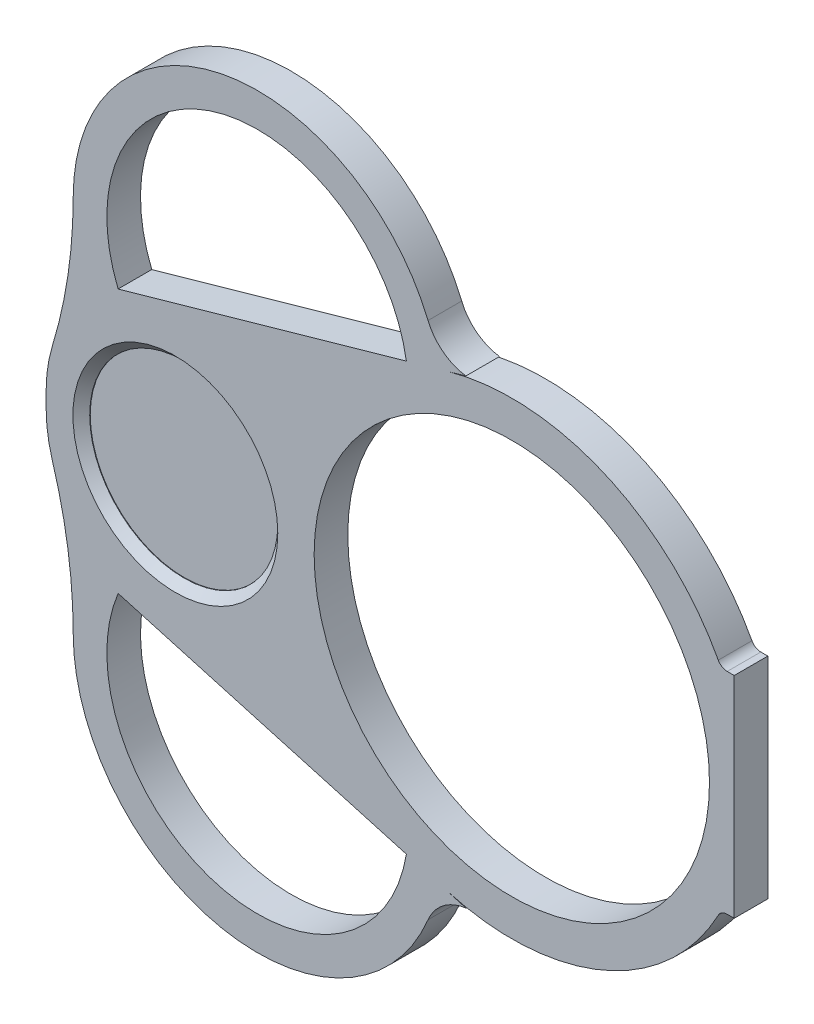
ISO-10303-21;
HEADER;
FILE_DESCRIPTION(('STEP AP214'),'2;1');
FILE_NAME('part.step','',(''),(''),'','','');
FILE_SCHEMA(('AUTOMOTIVE_DESIGN { 1 0 10303 214 1 1 1 1 }'));
ENDSEC;
DATA;
#1=APPLICATION_CONTEXT('core data for automotive mechanical design processes');
#2=APPLICATION_PROTOCOL_DEFINITION('international standard','automotive_design',2000,#1);
#3=PRODUCT_CONTEXT('',#1,'mechanical');
#4=PRODUCT('Part','Part','',(#3));
#5=PRODUCT_RELATED_PRODUCT_CATEGORY('part','',(#4));
#6=PRODUCT_DEFINITION_FORMATION('','',#4);
#7=PRODUCT_DEFINITION_CONTEXT('part definition',#1,'design');
#8=PRODUCT_DEFINITION('design','',#6,#7);
#9=PRODUCT_DEFINITION_SHAPE('','',#8);
#10=(LENGTH_UNIT() NAMED_UNIT(*) SI_UNIT(.MILLI.,.METRE.));
#11=(NAMED_UNIT(*) PLANE_ANGLE_UNIT() SI_UNIT($,.RADIAN.));
#12=(NAMED_UNIT(*) SI_UNIT($,.STERADIAN.) SOLID_ANGLE_UNIT());
#13=UNCERTAINTY_MEASURE_WITH_UNIT(LENGTH_MEASURE(1.E-05),#10,'distance_accuracy_value','');
#14=(GEOMETRIC_REPRESENTATION_CONTEXT(3) GLOBAL_UNCERTAINTY_ASSIGNED_CONTEXT((#13)) GLOBAL_UNIT_ASSIGNED_CONTEXT((#10,
#11,#12)) REPRESENTATION_CONTEXT('',''));
#15=CARTESIAN_POINT('',(0.,0.,0.));
#16=DIRECTION('',(0.,0.,1.));
#17=DIRECTION('',(1.,0.,0.));
#18=AXIS2_PLACEMENT_3D('',#15,#16,#17);
#19=CARTESIAN_POINT('',(-9.4234,0.,-1.016));
#20=DIRECTION('',(0.,0.,-1.));
#21=DIRECTION('',(-1.,0.,0.));
#22=AXIS2_PLACEMENT_3D('',#19,#20,#21);
#23=PLANE('',#22);
#24=CARTESIAN_POINT('',(-9.4234,0.,-1.0159999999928));
#25=DIRECTION('',(0.,0.,1.));
#26=DIRECTION('',(1.,0.,0.));
#27=AXIS2_PLACEMENT_3D('',#24,#25,#26);
#28=CIRCLE('',#27,6.46429999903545);
#29=CARTESIAN_POINT('',(-2.95910000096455,0.,-1.0159999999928));
#30=VERTEX_POINT('',#29);
#31=EDGE_CURVE('P0_E17',#30,#30,#28,.T.);
#32=ORIENTED_EDGE('',*,*,#31,.F.);
#33=EDGE_LOOP('',(#32));
#34=FACE_BOUND('',#33,.T.);
#35=ADVANCED_FACE('P0_F14',(#34),#23,.T.);
#36=CARTESIAN_POINT('',(-9.4234,0.,-0.381000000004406));
#37=DIRECTION('',(0.,0.,1.));
#38=DIRECTION('',(1.,0.,0.));
#39=AXIS2_PLACEMENT_3D('',#36,#37,#38);
#40=CONICAL_SURFACE('',#39,7.09929999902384,0.785398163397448);
#41=CARTESIAN_POINT('',(-9.4234,0.,-0.381000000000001));
#42=DIRECTION('',(0.,0.,-1.));
#43=DIRECTION('',(-1.,0.,0.));
#44=AXIS2_PLACEMENT_3D('',#41,#42,#43);
#45=CIRCLE('',#44,7.09929999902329);
#46=CARTESIAN_POINT('',(-16.5226999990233,0.,-0.381000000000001));
#47=VERTEX_POINT('',#46);
#48=EDGE_CURVE('P0_E21',#47,#47,#45,.F.);
#49=ORIENTED_EDGE('',*,*,#48,.F.);
#50=EDGE_LOOP('',(#49));
#51=FACE_BOUND('',#50,.T.);
#52=ORIENTED_EDGE('',*,*,#31,.T.);
#53=EDGE_LOOP('',(#52));
#54=FACE_BOUND('',#53,.T.);
#55=ADVANCED_FACE('P0_F31',(#51,#54),#40,.T.);
#56=CARTESIAN_POINT('',(-9.4234,0.,1.86626746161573));
#57=DIRECTION('',(0.,0.,-1.));
#58=DIRECTION('',(-1.,0.,0.));
#59=AXIS2_PLACEMENT_3D('',#56,#57,#58);
#60=CYLINDRICAL_SURFACE('',#59,7.09929999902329);
#61=ORIENTED_EDGE('',*,*,#48,.T.);
#62=EDGE_LOOP('',(#61));
#63=FACE_BOUND('',#62,.T.);
#64=CARTESIAN_POINT('',(-9.4234,0.,1.86626746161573));
#65=DIRECTION('',(0.,0.,-1.));
#66=DIRECTION('',(-1.,0.,0.));
#67=AXIS2_PLACEMENT_3D('',#64,#65,#66);
#68=CIRCLE('',#67,7.09929999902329);
#69=CARTESIAN_POINT('',(-16.5226999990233,0.,1.86626746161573));
#70=VERTEX_POINT('',#69);
#71=EDGE_CURVE('P0_E10',#70,#70,#68,.T.);
#72=ORIENTED_EDGE('',*,*,#71,.T.);
#73=EDGE_LOOP('',(#72));
#74=FACE_BOUND('',#73,.T.);
#75=ADVANCED_FACE('P0_F38',(#63,#74),#60,.T.);
#76=CARTESIAN_POINT('',(-9.4234,0.,1.86626746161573));
#77=DIRECTION('',(0.,0.,-1.));
#78=DIRECTION('',(-1.,0.,0.));
#79=AXIS2_PLACEMENT_3D('',#76,#77,#78);
#80=PLANE('',#79);
#81=ORIENTED_EDGE('',*,*,#71,.F.);
#82=EDGE_LOOP('',(#81));
#83=FACE_BOUND('',#82,.T.);
#84=ADVANCED_FACE('P0_F40',(#83),#80,.F.);
#85=CLOSED_SHELL('',(#35,#55,#75,#84));
#86=MANIFOLD_SOLID_BREP('P0_B1',#85);
#87=CARTESIAN_POINT('',(-19.177,0.,2.54));
#88=DIRECTION('',(1.,0.,0.));
#89=DIRECTION('',(0.,1.,0.));
#90=AXIS2_PLACEMENT_3D('',#87,#88,#89);
#91=PLANE('',#90);
#92=DIRECTION('',(0.,0.,-1.));
#93=VECTOR('',#92,1.);
#94=CARTESIAN_POINT('',(-19.177,-0.584199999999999,2.54));
#95=LINE('',#94,#93);
#96=CARTESIAN_POINT('',(-19.177,-0.584199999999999,2.54));
#97=VERTEX_POINT('',#96);
#98=CARTESIAN_POINT('',(-19.177,-0.584200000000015,0.));
#99=VERTEX_POINT('',#98);
#100=EDGE_CURVE('P1_E269',#97,#99,#95,.T.);
#101=ORIENTED_EDGE('',*,*,#100,.F.);
#102=DIRECTION('',(0.,1.,0.));
#103=VECTOR('',#102,1.);
#104=CARTESIAN_POINT('',(-19.177,0.,2.54));
#105=LINE('',#104,#103);
#106=CARTESIAN_POINT('',(-19.177,0.584199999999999,2.54));
#107=VERTEX_POINT('',#106);
#108=EDGE_CURVE('P1_E342',#107,#97,#105,.F.);
#109=ORIENTED_EDGE('',*,*,#108,.F.);
#110=DIRECTION('',(0.,0.,-1.));
#111=VECTOR('',#110,1.);
#112=CARTESIAN_POINT('',(-19.177,0.584199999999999,2.54));
#113=LINE('',#112,#111);
#114=CARTESIAN_POINT('',(-19.177,0.584199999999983,0.));
#115=VERTEX_POINT('',#114);
#116=EDGE_CURVE('P1_E273',#115,#107,#113,.F.);
#117=ORIENTED_EDGE('',*,*,#116,.F.);
#118=DIRECTION('',(0.,1.,0.));
#119=VECTOR('',#118,1.);
#120=CARTESIAN_POINT('',(-19.177,0.,0.));
#121=LINE('',#120,#119);
#122=EDGE_CURVE('P1_E167',#99,#115,#121,.T.);
#123=ORIENTED_EDGE('',*,*,#122,.F.);
#124=EDGE_LOOP('',(#101,#109,#117,#123));
#125=FACE_BOUND('',#124,.T.);
#126=ADVANCED_FACE('P1_F16',(#125),#91,.F.);
#127=CARTESIAN_POINT('',(32.2359681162,-8.6995,2.54));
#128=DIRECTION('',(0.,0.,-1.));
#129=DIRECTION('',(-1.,0.,0.));
#130=AXIS2_PLACEMENT_3D('',#127,#128,#129);
#131=CYLINDRICAL_SURFACE('',#130,0.761999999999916);
#132=DIRECTION('',(0.,0.,1.));
#133=VECTOR('',#132,1.);
#134=CARTESIAN_POINT('',(32.2359681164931,-7.93750000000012,2.54));
#135=LINE('',#134,#133);
#136=CARTESIAN_POINT('',(32.2359681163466,-7.93750000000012,2.54));
#137=VERTEX_POINT('',#136);
#138=CARTESIAN_POINT('',(32.2359681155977,-7.93750000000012,0.));
#139=VERTEX_POINT('',#138);
#140=EDGE_CURVE('P1_E159',#137,#139,#135,.F.);
#141=ORIENTED_EDGE('',*,*,#140,.F.);
#142=CARTESIAN_POINT('',(32.2359681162,-8.6995,2.54));
#143=DIRECTION('',(0.,0.,-1.));
#144=DIRECTION('',(-1.,0.,0.));
#145=AXIS2_PLACEMENT_3D('',#142,#143,#144);
#146=CIRCLE('',#145,0.761999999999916);
#147=CARTESIAN_POINT('',(31.5640934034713,-8.34001652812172,2.54));
#148=VERTEX_POINT('',#147);
#149=EDGE_CURVE('P1_E288',#148,#137,#146,.T.);
#150=ORIENTED_EDGE('',*,*,#149,.F.);
#151=DIRECTION('',(0.,0.,-1.));
#152=VECTOR('',#151,1.);
#153=CARTESIAN_POINT('',(31.5640934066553,-8.34001652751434,2.54));
#154=LINE('',#153,#152);
#155=CARTESIAN_POINT('',(31.5640934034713,-8.34001652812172,0.));
#156=VERTEX_POINT('',#155);
#157=EDGE_CURVE('P1_E161',#156,#148,#154,.F.);
#158=ORIENTED_EDGE('',*,*,#157,.F.);
#159=CARTESIAN_POINT('',(32.2359681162,-8.6995,0.));
#160=DIRECTION('',(0.,0.,-1.));
#161=DIRECTION('',(-1.,0.,0.));
#162=AXIS2_PLACEMENT_3D('',#159,#160,#161);
#163=CIRCLE('',#162,0.761999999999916);
#164=EDGE_CURVE('P1_E19',#139,#156,#163,.F.);
#165=ORIENTED_EDGE('',*,*,#164,.F.);
#166=EDGE_LOOP('',(#141,#150,#158,#165));
#167=FACE_BOUND('',#166,.T.);
#168=ADVANCED_FACE('P1_F157',(#167),#131,.F.);
#169=CARTESIAN_POINT('',(-3.63293960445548,-12.8163730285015,2.54));
#170=DIRECTION('',(-0.272716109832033,-0.962094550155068,0.));
#171=DIRECTION('',(0.962094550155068,-0.272716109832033,0.));
#172=AXIS2_PLACEMENT_3D('',#169,#170,#171);
#173=PLANE('',#172);
#174=DIRECTION('',(0.,0.,-1.));
#175=VECTOR('',#174,1.);
#176=CARTESIAN_POINT('',(11.1554155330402,-17.0082922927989,2.54));
#177=LINE('',#176,#175);
#178=CARTESIAN_POINT('',(11.1554155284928,-17.0082922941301,2.54));
#179=VERTEX_POINT('',#178);
#180=CARTESIAN_POINT('',(11.1554155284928,-17.0082922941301,0.));
#181=VERTEX_POINT('',#180);
#182=EDGE_CURVE('P1_E253',#179,#181,#177,.T.);
#183=ORIENTED_EDGE('',*,*,#182,.F.);
#184=DIRECTION('',(-0.962094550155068,0.272716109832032,0.));
#185=VECTOR('',#184,1.);
#186=CARTESIAN_POINT('',(12.511348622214,-17.3926462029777,2.54));
#187=LINE('',#186,#185);
#188=CARTESIAN_POINT('',(12.511348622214,-17.3926462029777,2.54));
#189=VERTEX_POINT('',#188);
#190=EDGE_CURVE('P1_E290',#189,#179,#187,.T.);
#191=ORIENTED_EDGE('',*,*,#190,.F.);
#192=DIRECTION('',(0.,0.,-1.));
#193=VECTOR('',#192,1.);
#194=CARTESIAN_POINT('',(12.511348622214,-17.3926462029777,2.54));
#195=LINE('',#194,#193);
#196=CARTESIAN_POINT('',(12.511348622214,-17.3926462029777,0.));
#197=VERTEX_POINT('',#196);
#198=EDGE_CURVE('P1_E257',#189,#197,#195,.T.);
#199=ORIENTED_EDGE('',*,*,#198,.T.);
#200=DIRECTION('',(0.962094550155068,-0.272716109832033,0.));
#201=VECTOR('',#200,1.);
#202=CARTESIAN_POINT('',(-3.63293960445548,-12.8163730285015,0.));
#203=LINE('',#202,#201);
#204=EDGE_CURVE('P1_E166',#181,#197,#203,.T.);
#205=ORIENTED_EDGE('',*,*,#204,.F.);
#206=EDGE_LOOP('',(#183,#191,#199,#205));
#207=FACE_BOUND('',#206,.T.);
#208=ADVANCED_FACE('P1_F641',(#207),#173,.F.);
#209=CARTESIAN_POINT('',(1.56023529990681E-08,-7.93750006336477,2.54));
#210=DIRECTION('',(1.96565075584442E-09,-1.,0.));
#211=DIRECTION('',(1.,1.96565075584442E-09,0.));
#212=AXIS2_PLACEMENT_3D('',#209,#210,#211);
#213=PLANE('',#212);
#214=DIRECTION('',(1.,0.,0.));
#215=VECTOR('',#214,1.);
#216=CARTESIAN_POINT('',(0.,-7.93750000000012,2.54));
#217=LINE('',#216,#215);
#218=CARTESIAN_POINT('',(32.766,-7.93749999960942,2.54));
#219=VERTEX_POINT('',#218);
#220=EDGE_CURVE('P1_E175',#137,#219,#217,.T.);
#221=ORIENTED_EDGE('',*,*,#220,.F.);
#222=ORIENTED_EDGE('',*,*,#140,.T.);
#223=DIRECTION('',(1.,1.96565075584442E-09,0.));
#224=VECTOR('',#223,1.);
#225=CARTESIAN_POINT('',(1.56023529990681E-08,-7.93750006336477,0.));
#226=LINE('',#225,#224);
#227=CARTESIAN_POINT('',(32.766,-7.93749999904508,0.));
#228=VERTEX_POINT('',#227);
#229=EDGE_CURVE('P1_E172',#139,#228,#226,.T.);
#230=ORIENTED_EDGE('',*,*,#229,.T.);
#231=DIRECTION('',(0.,0.,1.));
#232=VECTOR('',#231,1.);
#233=CARTESIAN_POINT('',(32.766,-7.93749999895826,2.54));
#234=LINE('',#233,#232);
#235=EDGE_CURVE('P1_E315',#228,#219,#234,.T.);
#236=ORIENTED_EDGE('',*,*,#235,.T.);
#237=EDGE_LOOP('',(#221,#222,#230,#236));
#238=FACE_BOUND('',#237,.T.);
#239=ADVANCED_FACE('P1_F170',(#238),#213,.T.);
#240=CARTESIAN_POINT('',(1.56004825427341E-08,7.93750006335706,2.54));
#241=DIRECTION('',(1.96541510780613E-09,1.,0.));
#242=DIRECTION('',(-1.,1.96541510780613E-09,0.));
#243=AXIS2_PLACEMENT_3D('',#240,#241,#242);
#244=PLANE('',#243);
#245=DIRECTION('',(1.,0.,0.));
#246=VECTOR('',#245,1.);
#247=CARTESIAN_POINT('',(0.,7.93749999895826,2.54));
#248=LINE('',#247,#246);
#249=CARTESIAN_POINT('',(32.766,7.93749999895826,2.54));
#250=VERTEX_POINT('',#249);
#251=CARTESIAN_POINT('',(32.2359681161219,7.93750000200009,2.54));
#252=VERTEX_POINT('',#251);
#253=EDGE_CURVE('P1_E287',#250,#252,#248,.F.);
#254=ORIENTED_EDGE('',*,*,#253,.F.);
#255=DIRECTION('',(0.,0.,1.));
#256=VECTOR('',#255,1.);
#257=CARTESIAN_POINT('',(32.766,7.93749999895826,2.54));
#258=LINE('',#257,#256);
#259=CARTESIAN_POINT('',(32.766,7.93749999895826,0.));
#260=VERTEX_POINT('',#259);
#261=EDGE_CURVE('P1_E307',#250,#260,#258,.F.);
#262=ORIENTED_EDGE('',*,*,#261,.T.);
#263=DIRECTION('',(-1.,1.96541510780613E-09,0.));
#264=VECTOR('',#263,1.);
#265=CARTESIAN_POINT('',(1.56004825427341E-08,7.93750006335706,0.));
#266=LINE('',#265,#264);
#267=CARTESIAN_POINT('',(32.235968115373,7.93750000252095,0.));
#268=VERTEX_POINT('',#267);
#269=EDGE_CURVE('P1_E176',#260,#268,#266,.T.);
#270=ORIENTED_EDGE('',*,*,#269,.T.);
#271=DIRECTION('',(0.,0.,-1.));
#272=VECTOR('',#271,1.);
#273=CARTESIAN_POINT('',(32.2359681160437,7.93750000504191,2.54));
#274=LINE('',#273,#272);
#275=EDGE_CURVE('P1_E295',#268,#252,#274,.F.);
#276=ORIENTED_EDGE('',*,*,#275,.T.);
#277=EDGE_LOOP('',(#254,#262,#270,#276));
#278=FACE_BOUND('',#277,.T.);
#279=ADVANCED_FACE('P1_F329',(#278),#244,.T.);
#280=CARTESIAN_POINT('',(-3.63293960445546,12.8163730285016,2.54));
#281=DIRECTION('',(0.272716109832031,-0.962094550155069,0.));
#282=DIRECTION('',(0.962094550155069,0.272716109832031,0.));
#283=AXIS2_PLACEMENT_3D('',#280,#281,#282);
#284=PLANE('',#283);
#285=DIRECTION('',(0.962094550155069,0.27271610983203,0.));
#286=VECTOR('',#285,1.);
#287=CARTESIAN_POINT('',(11.1554155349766,17.0082922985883,2.54));
#288=LINE('',#287,#286);
#289=CARTESIAN_POINT('',(11.155415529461,17.0082922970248,2.54));
#290=VERTEX_POINT('',#289);
#291=CARTESIAN_POINT('',(12.511348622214,17.3926462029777,2.54));
#292=VERTEX_POINT('',#291);
#293=EDGE_CURVE('P1_E293',#290,#292,#288,.T.);
#294=ORIENTED_EDGE('',*,*,#293,.F.);
#295=DIRECTION('',(0.,0.,-1.));
#296=VECTOR('',#295,1.);
#297=CARTESIAN_POINT('',(11.1554155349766,17.0082922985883,2.54));
#298=LINE('',#297,#296);
#299=CARTESIAN_POINT('',(11.155415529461,17.0082922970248,0.));
#300=VERTEX_POINT('',#299);
#301=EDGE_CURVE('P1_E249',#300,#290,#298,.F.);
#302=ORIENTED_EDGE('',*,*,#301,.F.);
#303=DIRECTION('',(0.962094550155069,0.272716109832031,0.));
#304=VECTOR('',#303,1.);
#305=CARTESIAN_POINT('',(-3.63293960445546,12.8163730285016,0.));
#306=LINE('',#305,#304);
#307=CARTESIAN_POINT('',(12.511348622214,17.3926462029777,0.));
#308=VERTEX_POINT('',#307);
#309=EDGE_CURVE('P1_E298',#300,#308,#306,.T.);
#310=ORIENTED_EDGE('',*,*,#309,.T.);
#311=DIRECTION('',(0.,0.,-1.));
#312=VECTOR('',#311,1.);
#313=CARTESIAN_POINT('',(12.511348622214,17.3926462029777,2.54));
#314=LINE('',#313,#312);
#315=EDGE_CURVE('P1_E284',#308,#292,#314,.F.);
#316=ORIENTED_EDGE('',*,*,#315,.T.);
#317=EDGE_LOOP('',(#294,#302,#310,#316));
#318=FACE_BOUND('',#317,.T.);
#319=ADVANCED_FACE('P1_F381',(#318),#284,.T.);
#320=CARTESIAN_POINT('',(32.2359681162,8.6995,2.54));
#321=DIRECTION('',(0.,0.,-1.));
#322=DIRECTION('',(-1.,0.,0.));
#323=AXIS2_PLACEMENT_3D('',#320,#321,#322);
#324=CYLINDRICAL_SURFACE('',#323,0.761999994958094);
#325=DIRECTION('',(0.,0.,-1.));
#326=VECTOR('',#325,1.);
#327=CARTESIAN_POINT('',(31.5640934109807,8.34001653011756,2.54));
#328=LINE('',#327,#326);
#329=CARTESIAN_POINT('',(31.5640934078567,8.34001653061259,2.54));
#330=VERTEX_POINT('',#329);
#331=CARTESIAN_POINT('',(31.5640934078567,8.34001653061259,0.));
#332=VERTEX_POINT('',#331);
#333=EDGE_CURVE('P1_E245',#330,#332,#328,.T.);
#334=ORIENTED_EDGE('',*,*,#333,.F.);
#335=CARTESIAN_POINT('',(32.2359681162,8.6995,2.54));
#336=DIRECTION('',(0.,0.,-1.));
#337=DIRECTION('',(-1.,0.,0.));
#338=AXIS2_PLACEMENT_3D('',#335,#336,#337);
#339=CIRCLE('',#338,0.761999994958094);
#340=EDGE_CURVE('P1_E285',#252,#330,#339,.T.);
#341=ORIENTED_EDGE('',*,*,#340,.F.);
#342=ORIENTED_EDGE('',*,*,#275,.F.);
#343=CARTESIAN_POINT('',(32.2359681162,8.6995,0.));
#344=DIRECTION('',(0.,0.,-1.));
#345=DIRECTION('',(-1.,0.,0.));
#346=AXIS2_PLACEMENT_3D('',#343,#344,#345);
#347=CIRCLE('',#346,0.761999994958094);
#348=EDGE_CURVE('P1_E294',#332,#268,#347,.F.);
#349=ORIENTED_EDGE('',*,*,#348,.F.);
#350=EDGE_LOOP('',(#334,#341,#342,#349));
#351=FACE_BOUND('',#350,.T.);
#352=ADVANCED_FACE('P1_F401',(#351),#324,.F.);
#353=CARTESIAN_POINT('',(-9.4234,0.,2.54));
#354=DIRECTION('',(0.,0.,1.));
#355=DIRECTION('',(1.,0.,0.));
#356=AXIS2_PLACEMENT_3D('',#353,#354,#355);
#357=CONICAL_SURFACE('',#356,7.7342999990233,0.785398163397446);
#358=CARTESIAN_POINT('',(-9.4234,0.,2.54));
#359=DIRECTION('',(0.,0.,1.));
#360=DIRECTION('',(1.,0.,0.));
#361=AXIS2_PLACEMENT_3D('',#358,#359,#360);
#362=CIRCLE('',#361,7.7342999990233);
#363=CARTESIAN_POINT('',(-1.68910000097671,0.,2.54));
#364=VERTEX_POINT('',#363);
#365=EDGE_CURVE('P1_E291',#364,#364,#362,.F.);
#366=ORIENTED_EDGE('',*,*,#365,.F.);
#367=EDGE_LOOP('',(#366));
#368=FACE_BOUND('',#367,.T.);
#369=CARTESIAN_POINT('',(-9.4234,0.,1.90499999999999));
#370=DIRECTION('',(0.,0.,-1.));
#371=DIRECTION('',(-1.,0.,0.));
#372=AXIS2_PLACEMENT_3D('',#369,#370,#371);
#373=CIRCLE('',#372,7.09929999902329);
#374=CARTESIAN_POINT('',(-16.5226999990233,0.,1.90499999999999));
#375=VERTEX_POINT('',#374);
#376=EDGE_CURVE('P1_E236',#375,#375,#373,.T.);
#377=ORIENTED_EDGE('',*,*,#376,.T.);
#378=EDGE_LOOP('',(#377));
#379=FACE_BOUND('',#378,.T.);
#380=ADVANCED_FACE('P1_F403',(#368,#379),#357,.F.);
#381=CARTESIAN_POINT('',(0.,0.,2.54));
#382=DIRECTION('',(0.,0.,1.));
#383=DIRECTION('',(1.,0.,0.));
#384=AXIS2_PLACEMENT_3D('',#381,#382,#383);
#385=PLANE('',#384);
#386=DIRECTION('',(-0.96209455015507,-0.272716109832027,0.));
#387=VECTOR('',#386,1.);
#388=CARTESIAN_POINT('',(-3.63293960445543,12.8163730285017,2.54));
#389=LINE('',#388,#387);
#390=CARTESIAN_POINT('',(-13.7440850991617,9.95025943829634,2.54));
#391=VERTEX_POINT('',#390);
#392=CARTESIAN_POINT('',(8.01865249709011,16.1191428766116,2.54));
#393=VERTEX_POINT('',#392);
#394=EDGE_CURVE('P1_E335',#391,#393,#389,.F.);
#395=ORIENTED_EDGE('',*,*,#394,.F.);
#396=CARTESIAN_POINT('',(-3.21189337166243,14.2665365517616,2.54));
#397=DIRECTION('',(0.,0.,-1.));
#398=DIRECTION('',(-1.,0.,0.));
#399=AXIS2_PLACEMENT_3D('',#396,#397,#398);
#400=CIRCLE('',#399,11.3823244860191);
#401=EDGE_CURVE('P1_E232',#391,#393,#400,.T.);
#402=ORIENTED_EDGE('',*,*,#401,.T.);
#403=EDGE_LOOP('',(#395,#402));
#404=FACE_BOUND('',#403,.T.);
#405=DIRECTION('',(-0.96209455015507,0.272716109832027,0.));
#406=VECTOR('',#405,1.);
#407=CARTESIAN_POINT('',(-3.63293960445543,-12.8163730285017,2.54));
#408=LINE('',#407,#406);
#409=CARTESIAN_POINT('',(-13.7440850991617,-9.95025943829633,2.54));
#410=VERTEX_POINT('',#409);
#411=CARTESIAN_POINT('',(8.01865249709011,-16.1191428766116,2.54));
#412=VERTEX_POINT('',#411);
#413=EDGE_CURVE('P1_E244',#410,#412,#408,.F.);
#414=ORIENTED_EDGE('',*,*,#413,.T.);
#415=CARTESIAN_POINT('',(-3.21189337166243,-14.2665365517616,2.54));
#416=DIRECTION('',(0.,0.,-1.));
#417=DIRECTION('',(-1.,0.,0.));
#418=AXIS2_PLACEMENT_3D('',#415,#416,#417);
#419=CIRCLE('',#418,11.3823244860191);
#420=EDGE_CURVE('P1_E237',#412,#410,#419,.T.);
#421=ORIENTED_EDGE('',*,*,#420,.T.);
#422=EDGE_LOOP('',(#414,#421));
#423=FACE_BOUND('',#422,.T.);
#424=CARTESIAN_POINT('',(15.9765999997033,-7.72285374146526E-08,2.54));
#425=DIRECTION('',(0.,0.,-1.));
#426=DIRECTION('',(-1.,0.,0.));
#427=AXIS2_PLACEMENT_3D('',#424,#425,#426);
#428=CIRCLE('',#427,14.9224999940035);
#429=CARTESIAN_POINT('',(1.05410000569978,-7.72285374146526E-08,2.54));
#430=VERTEX_POINT('',#429);
#431=EDGE_CURVE('P1_E241',#430,#430,#428,.T.);
#432=ORIENTED_EDGE('',*,*,#431,.T.);
#433=EDGE_LOOP('',(#432));
#434=FACE_BOUND('',#433,.T.);
#435=ORIENTED_EDGE('',*,*,#253,.T.);
#436=ORIENTED_EDGE('',*,*,#340,.T.);
#437=CARTESIAN_POINT('',(15.9766,0.,2.54));
#438=DIRECTION('',(0.,0.,-1.));
#439=DIRECTION('',(-1.,0.,0.));
#440=AXIS2_PLACEMENT_3D('',#437,#438,#439);
#441=CIRCLE('',#440,17.6784);
#442=EDGE_CURVE('P1_E246',#290,#330,#441,.T.);
#443=ORIENTED_EDGE('',*,*,#442,.F.);
#444=ORIENTED_EDGE('',*,*,#293,.T.);
#445=CARTESIAN_POINT('',(12.9864087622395,20.9691813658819,2.54));
#446=DIRECTION('',(0.,0.,-1.));
#447=DIRECTION('',(-1.,0.,0.));
#448=AXIS2_PLACEMENT_3D('',#445,#446,#447);
#449=CIRCLE('',#448,3.60794760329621);
#450=CARTESIAN_POINT('',(9.65259710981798,19.5896938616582,2.54));
#451=VERTEX_POINT('',#450);
#452=EDGE_CURVE('P1_E281',#292,#451,#449,.T.);
#453=ORIENTED_EDGE('',*,*,#452,.T.);
#454=CARTESIAN_POINT('',(-3.21189337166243,14.2665365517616,2.54));
#455=DIRECTION('',(0.,0.,-1.));
#456=DIRECTION('',(-1.,0.,0.));
#457=AXIS2_PLACEMENT_3D('',#454,#455,#456);
#458=CIRCLE('',#457,13.9223244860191);
#459=CARTESIAN_POINT('',(-17.1342178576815,14.2665365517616,2.54));
#460=VERTEX_POINT('',#459);
#461=EDGE_CURVE('P1_E278',#460,#451,#458,.T.);
#462=ORIENTED_EDGE('',*,*,#461,.F.);
#463=CARTESIAN_POINT('',(-53.0550231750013,14.2665365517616,2.54));
#464=DIRECTION('',(0.,0.,-1.));
#465=DIRECTION('',(-1.,0.,0.));
#466=AXIS2_PLACEMENT_3D('',#463,#464,#465);
#467=CIRCLE('',#466,35.9208053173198);
#468=CARTESIAN_POINT('',(-18.7006991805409,3.77441200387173,2.54));
#469=VERTEX_POINT('',#468);
#470=EDGE_CURVE('P1_E274',#460,#469,#467,.T.);
#471=ORIENTED_EDGE('',*,*,#470,.T.);
#472=CARTESIAN_POINT('',(-8.255,0.584199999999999,2.54));
#473=DIRECTION('',(0.,0.,-1.));
#474=DIRECTION('',(-1.,0.,0.));
#475=AXIS2_PLACEMENT_3D('',#472,#473,#474);
#476=CIRCLE('',#475,10.922);
#477=EDGE_CURVE('P1_E271',#107,#469,#476,.T.);
#478=ORIENTED_EDGE('',*,*,#477,.F.);
#479=ORIENTED_EDGE('',*,*,#108,.T.);
#480=CARTESIAN_POINT('',(-8.255,-0.584199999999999,2.54));
#481=DIRECTION('',(0.,0.,-1.));
#482=DIRECTION('',(-1.,0.,0.));
#483=AXIS2_PLACEMENT_3D('',#480,#481,#482);
#484=CIRCLE('',#483,10.922);
#485=CARTESIAN_POINT('',(-18.7006991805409,-3.77441200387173,2.54));
#486=VERTEX_POINT('',#485);
#487=EDGE_CURVE('P1_E266',#486,#97,#484,.T.);
#488=ORIENTED_EDGE('',*,*,#487,.F.);
#489=CARTESIAN_POINT('',(-53.0550231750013,-14.2665365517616,2.54));
#490=DIRECTION('',(0.,0.,-1.));
#491=DIRECTION('',(-1.,0.,0.));
#492=AXIS2_PLACEMENT_3D('',#489,#490,#491);
#493=CIRCLE('',#492,35.9208053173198);
#494=CARTESIAN_POINT('',(-17.1342178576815,-14.2665365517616,2.54));
#495=VERTEX_POINT('',#494);
#496=EDGE_CURVE('P1_E262',#486,#495,#493,.T.);
#497=ORIENTED_EDGE('',*,*,#496,.T.);
#498=CARTESIAN_POINT('',(-3.21189337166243,-14.2665365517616,2.54));
#499=DIRECTION('',(0.,0.,-1.));
#500=DIRECTION('',(-1.,0.,0.));
#501=AXIS2_PLACEMENT_3D('',#498,#499,#500);
#502=CIRCLE('',#501,13.9223244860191);
#503=CARTESIAN_POINT('',(9.65259710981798,-19.5896938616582,2.54));
#504=VERTEX_POINT('',#503);
#505=EDGE_CURVE('P1_E259',#504,#495,#502,.T.);
#506=ORIENTED_EDGE('',*,*,#505,.F.);
#507=CARTESIAN_POINT('',(12.9864087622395,-20.9691813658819,2.54));
#508=DIRECTION('',(0.,0.,-1.));
#509=DIRECTION('',(-1.,0.,0.));
#510=AXIS2_PLACEMENT_3D('',#507,#508,#509);
#511=CIRCLE('',#510,3.60794760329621);
#512=EDGE_CURVE('P1_E254',#504,#189,#511,.T.);
#513=ORIENTED_EDGE('',*,*,#512,.T.);
#514=ORIENTED_EDGE('',*,*,#190,.T.);
#515=CARTESIAN_POINT('',(15.9766,0.,2.54));
#516=DIRECTION('',(0.,0.,-1.));
#517=DIRECTION('',(-1.,0.,0.));
#518=AXIS2_PLACEMENT_3D('',#515,#516,#517);
#519=CIRCLE('',#518,17.6783999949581);
#520=EDGE_CURVE('P1_E250',#148,#179,#519,.T.);
#521=ORIENTED_EDGE('',*,*,#520,.F.);
#522=ORIENTED_EDGE('',*,*,#149,.T.);
#523=ORIENTED_EDGE('',*,*,#220,.T.);
#524=DIRECTION('',(0.,1.,0.));
#525=VECTOR('',#524,1.);
#526=CARTESIAN_POINT('',(32.766,0.,2.54));
#527=LINE('',#526,#525);
#528=EDGE_CURVE('P1_E310',#219,#250,#527,.T.);
#529=ORIENTED_EDGE('',*,*,#528,.T.);
#530=EDGE_LOOP('',(#435,#436,#443,#444,#453,#462,#471,#478,#479,#488,#497,#506,#513,#514,#521,
#522,#523,#529));
#531=FACE_BOUND('',#530,.T.);
#532=ORIENTED_EDGE('',*,*,#365,.T.);
#533=EDGE_LOOP('',(#532));
#534=FACE_BOUND('',#533,.T.);
#535=ADVANCED_FACE('P1_F395',(#404,#423,#434,#531,#534),#385,.T.);
#536=CARTESIAN_POINT('',(12.9864087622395,20.9691813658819,2.54));
#537=DIRECTION('',(0.,0.,-1.));
#538=DIRECTION('',(-1.,0.,0.));
#539=AXIS2_PLACEMENT_3D('',#536,#537,#538);
#540=CYLINDRICAL_SURFACE('',#539,3.60794760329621);
#541=DIRECTION('',(0.,0.,-1.));
#542=VECTOR('',#541,1.);
#543=CARTESIAN_POINT('',(9.65259710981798,19.5896938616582,2.54));
#544=LINE('',#543,#542);
#545=CARTESIAN_POINT('',(9.65259710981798,19.5896938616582,0.));
#546=VERTEX_POINT('',#545);
#547=EDGE_CURVE('P1_E280',#451,#546,#544,.T.);
#548=ORIENTED_EDGE('',*,*,#547,.F.);
#549=ORIENTED_EDGE('',*,*,#452,.F.);
#550=ORIENTED_EDGE('',*,*,#315,.F.);
#551=CARTESIAN_POINT('',(12.9864087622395,20.9691813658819,0.));
#552=DIRECTION('',(0.,0.,-1.));
#553=DIRECTION('',(-1.,0.,0.));
#554=AXIS2_PLACEMENT_3D('',#551,#552,#553);
#555=CIRCLE('',#554,3.60794760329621);
#556=EDGE_CURVE('P1_E228',#308,#546,#555,.T.);
#557=ORIENTED_EDGE('',*,*,#556,.T.);
#558=EDGE_LOOP('',(#548,#549,#550,#557));
#559=FACE_BOUND('',#558,.T.);
#560=ADVANCED_FACE('P1_F388',(#559),#540,.F.);
#561=CARTESIAN_POINT('',(-3.21189337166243,14.2665365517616,2.54));
#562=DIRECTION('',(0.,0.,-1.));
#563=DIRECTION('',(-1.,0.,0.));
#564=AXIS2_PLACEMENT_3D('',#561,#562,#563);
#565=CYLINDRICAL_SURFACE('',#564,13.9223244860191);
#566=ORIENTED_EDGE('',*,*,#461,.T.);
#567=ORIENTED_EDGE('',*,*,#547,.T.);
#568=CARTESIAN_POINT('',(-3.21189337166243,14.2665365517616,0.));
#569=DIRECTION('',(0.,0.,-1.));
#570=DIRECTION('',(-1.,0.,0.));
#571=AXIS2_PLACEMENT_3D('',#568,#569,#570);
#572=CIRCLE('',#571,13.9223244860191);
#573=CARTESIAN_POINT('',(-17.1342178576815,14.2665365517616,0.));
#574=VERTEX_POINT('',#573);
#575=EDGE_CURVE('P1_E225',#546,#574,#572,.F.);
#576=ORIENTED_EDGE('',*,*,#575,.T.);
#577=DIRECTION('',(0.,0.,-1.));
#578=VECTOR('',#577,1.);
#579=CARTESIAN_POINT('',(-17.1342178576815,14.2665365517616,2.54));
#580=LINE('',#579,#578);
#581=EDGE_CURVE('P1_E277',#574,#460,#580,.F.);
#582=ORIENTED_EDGE('',*,*,#581,.T.);
#583=EDGE_LOOP('',(#566,#567,#576,#582));
#584=FACE_BOUND('',#583,.T.);
#585=ADVANCED_FACE('P1_F393',(#584),#565,.T.);
#586=CARTESIAN_POINT('',(-53.0550231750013,14.2665365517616,2.54));
#587=DIRECTION('',(0.,0.,-1.));
#588=DIRECTION('',(-1.,0.,0.));
#589=AXIS2_PLACEMENT_3D('',#586,#587,#588);
#590=CYLINDRICAL_SURFACE('',#589,35.9208053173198);
#591=DIRECTION('',(0.,0.,-1.));
#592=VECTOR('',#591,1.);
#593=CARTESIAN_POINT('',(-18.7006991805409,3.77441200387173,2.54));
#594=LINE('',#593,#592);
#595=CARTESIAN_POINT('',(-18.7006991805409,3.77441200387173,0.));
#596=VERTEX_POINT('',#595);
#597=EDGE_CURVE('P1_E270',#469,#596,#594,.T.);
#598=ORIENTED_EDGE('',*,*,#597,.F.);
#599=ORIENTED_EDGE('',*,*,#470,.F.);
#600=ORIENTED_EDGE('',*,*,#581,.F.);
#601=CARTESIAN_POINT('',(-53.0550231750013,14.2665365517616,0.));
#602=DIRECTION('',(0.,0.,-1.));
#603=DIRECTION('',(-1.,0.,0.));
#604=AXIS2_PLACEMENT_3D('',#601,#602,#603);
#605=CIRCLE('',#604,35.9208053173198);
#606=EDGE_CURVE('P1_E222',#574,#596,#605,.T.);
#607=ORIENTED_EDGE('',*,*,#606,.T.);
#608=EDGE_LOOP('',(#598,#599,#600,#607));
#609=FACE_BOUND('',#608,.T.);
#610=ADVANCED_FACE('P1_F470',(#609),#590,.F.);
#611=CARTESIAN_POINT('',(-8.255,0.584199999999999,2.54));
#612=DIRECTION('',(0.,0.,-1.));
#613=DIRECTION('',(-1.,0.,0.));
#614=AXIS2_PLACEMENT_3D('',#611,#612,#613);
#615=CYLINDRICAL_SURFACE('',#614,10.922);
#616=ORIENTED_EDGE('',*,*,#477,.T.);
#617=ORIENTED_EDGE('',*,*,#597,.T.);
#618=CARTESIAN_POINT('',(-8.255,0.584199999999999,0.));
#619=DIRECTION('',(0.,0.,-1.));
#620=DIRECTION('',(-1.,0.,0.));
#621=AXIS2_PLACEMENT_3D('',#618,#619,#620);
#622=CIRCLE('',#621,10.922);
#623=EDGE_CURVE('P1_E219',#596,#115,#622,.F.);
#624=ORIENTED_EDGE('',*,*,#623,.T.);
#625=ORIENTED_EDGE('',*,*,#116,.T.);
#626=EDGE_LOOP('',(#616,#617,#624,#625));
#627=FACE_BOUND('',#626,.T.);
#628=ADVANCED_FACE('P1_F466',(#627),#615,.T.);
#629=CARTESIAN_POINT('',(-8.255,-0.584199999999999,2.54));
#630=DIRECTION('',(0.,0.,-1.));
#631=DIRECTION('',(-1.,0.,0.));
#632=AXIS2_PLACEMENT_3D('',#629,#630,#631);
#633=CYLINDRICAL_SURFACE('',#632,10.922);
#634=ORIENTED_EDGE('',*,*,#487,.T.);
#635=ORIENTED_EDGE('',*,*,#100,.T.);
#636=CARTESIAN_POINT('',(-8.255,-0.584199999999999,0.));
#637=DIRECTION('',(0.,0.,-1.));
#638=DIRECTION('',(-1.,0.,0.));
#639=AXIS2_PLACEMENT_3D('',#636,#637,#638);
#640=CIRCLE('',#639,10.922);
#641=CARTESIAN_POINT('',(-18.7006991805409,-3.77441200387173,0.));
#642=VERTEX_POINT('',#641);
#643=EDGE_CURVE('P1_E216',#99,#642,#640,.F.);
#644=ORIENTED_EDGE('',*,*,#643,.T.);
#645=DIRECTION('',(0.,0.,-1.));
#646=VECTOR('',#645,1.);
#647=CARTESIAN_POINT('',(-18.7006991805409,-3.77441200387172,2.54));
#648=LINE('',#647,#646);
#649=EDGE_CURVE('P1_E265',#642,#486,#648,.F.);
#650=ORIENTED_EDGE('',*,*,#649,.T.);
#651=EDGE_LOOP('',(#634,#635,#644,#650));
#652=FACE_BOUND('',#651,.T.);
#653=ADVANCED_FACE('P1_F462',(#652),#633,.T.);
#654=CARTESIAN_POINT('',(-53.0550231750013,-14.2665365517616,2.54));
#655=DIRECTION('',(0.,0.,-1.));
#656=DIRECTION('',(-1.,0.,0.));
#657=AXIS2_PLACEMENT_3D('',#654,#655,#656);
#658=CYLINDRICAL_SURFACE('',#657,35.9208053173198);
#659=DIRECTION('',(0.,0.,-1.));
#660=VECTOR('',#659,1.);
#661=CARTESIAN_POINT('',(-17.1342178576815,-14.2665365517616,2.54));
#662=LINE('',#661,#660);
#663=CARTESIAN_POINT('',(-17.1342178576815,-14.2665365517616,0.));
#664=VERTEX_POINT('',#663);
#665=EDGE_CURVE('P1_E261',#495,#664,#662,.T.);
#666=ORIENTED_EDGE('',*,*,#665,.F.);
#667=ORIENTED_EDGE('',*,*,#496,.F.);
#668=ORIENTED_EDGE('',*,*,#649,.F.);
#669=CARTESIAN_POINT('',(-53.0550231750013,-14.2665365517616,0.));
#670=DIRECTION('',(0.,0.,-1.));
#671=DIRECTION('',(-1.,0.,0.));
#672=AXIS2_PLACEMENT_3D('',#669,#670,#671);
#673=CIRCLE('',#672,35.9208053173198);
#674=EDGE_CURVE('P1_E213',#642,#664,#673,.T.);
#675=ORIENTED_EDGE('',*,*,#674,.T.);
#676=EDGE_LOOP('',(#666,#667,#668,#675));
#677=FACE_BOUND('',#676,.T.);
#678=ADVANCED_FACE('P1_F458',(#677),#658,.F.);
#679=CARTESIAN_POINT('',(-3.21189337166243,-14.2665365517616,2.54));
#680=DIRECTION('',(0.,0.,-1.));
#681=DIRECTION('',(-1.,0.,0.));
#682=AXIS2_PLACEMENT_3D('',#679,#680,#681);
#683=CYLINDRICAL_SURFACE('',#682,13.9223244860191);
#684=ORIENTED_EDGE('',*,*,#505,.T.);
#685=ORIENTED_EDGE('',*,*,#665,.T.);
#686=CARTESIAN_POINT('',(-3.21189337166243,-14.2665365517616,0.));
#687=DIRECTION('',(0.,0.,-1.));
#688=DIRECTION('',(-1.,0.,0.));
#689=AXIS2_PLACEMENT_3D('',#686,#687,#688);
#690=CIRCLE('',#689,13.9223244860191);
#691=CARTESIAN_POINT('',(9.65259710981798,-19.5896938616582,0.));
#692=VERTEX_POINT('',#691);
#693=EDGE_CURVE('P1_E210',#664,#692,#690,.F.);
#694=ORIENTED_EDGE('',*,*,#693,.T.);
#695=DIRECTION('',(0.,0.,-1.));
#696=VECTOR('',#695,1.);
#697=CARTESIAN_POINT('',(9.65259710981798,-19.5896938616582,2.54));
#698=LINE('',#697,#696);
#699=EDGE_CURVE('P1_E258',#692,#504,#698,.F.);
#700=ORIENTED_EDGE('',*,*,#699,.T.);
#701=EDGE_LOOP('',(#684,#685,#694,#700));
#702=FACE_BOUND('',#701,.T.);
#703=ADVANCED_FACE('P1_F454',(#702),#683,.T.);
#704=CARTESIAN_POINT('',(12.9864087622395,-20.9691813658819,2.54));
#705=DIRECTION('',(0.,0.,-1.));
#706=DIRECTION('',(-1.,0.,0.));
#707=AXIS2_PLACEMENT_3D('',#704,#705,#706);
#708=CYLINDRICAL_SURFACE('',#707,3.60794760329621);
#709=ORIENTED_EDGE('',*,*,#198,.F.);
#710=ORIENTED_EDGE('',*,*,#512,.F.);
#711=ORIENTED_EDGE('',*,*,#699,.F.);
#712=CARTESIAN_POINT('',(12.9864087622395,-20.9691813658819,0.));
#713=DIRECTION('',(0.,0.,-1.));
#714=DIRECTION('',(-1.,0.,0.));
#715=AXIS2_PLACEMENT_3D('',#712,#713,#714);
#716=CIRCLE('',#715,3.60794760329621);
#717=EDGE_CURVE('P1_E207',#692,#197,#716,.T.);
#718=ORIENTED_EDGE('',*,*,#717,.T.);
#719=EDGE_LOOP('',(#709,#710,#711,#718));
#720=FACE_BOUND('',#719,.T.);
#721=ADVANCED_FACE('P1_F450',(#720),#708,.F.);
#722=CARTESIAN_POINT('',(15.9766,0.,2.54));
#723=DIRECTION('',(0.,0.,-1.));
#724=DIRECTION('',(-1.,0.,0.));
#725=AXIS2_PLACEMENT_3D('',#722,#723,#724);
#726=CYLINDRICAL_SURFACE('',#725,17.6783999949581);
#727=ORIENTED_EDGE('',*,*,#520,.T.);
#728=ORIENTED_EDGE('',*,*,#182,.T.);
#729=CARTESIAN_POINT('',(15.9766,0.,0.));
#730=DIRECTION('',(0.,0.,-1.));
#731=DIRECTION('',(-1.,0.,0.));
#732=AXIS2_PLACEMENT_3D('',#729,#730,#731);
#733=CIRCLE('',#732,17.6783999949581);
#734=EDGE_CURVE('P1_E205',#181,#156,#733,.F.);
#735=ORIENTED_EDGE('',*,*,#734,.T.);
#736=ORIENTED_EDGE('',*,*,#157,.T.);
#737=EDGE_LOOP('',(#727,#728,#735,#736));
#738=FACE_BOUND('',#737,.T.);
#739=ADVANCED_FACE('P1_F447',(#738),#726,.T.);
#740=CARTESIAN_POINT('',(32.766,0.,2.54));
#741=DIRECTION('',(-1.,0.,0.));
#742=DIRECTION('',(0.,0.,1.));
#743=AXIS2_PLACEMENT_3D('',#740,#741,#742);
#744=PLANE('',#743);
#745=ORIENTED_EDGE('',*,*,#261,.F.);
#746=ORIENTED_EDGE('',*,*,#528,.F.);
#747=ORIENTED_EDGE('',*,*,#235,.F.);
#748=DIRECTION('',(0.,1.,0.));
#749=VECTOR('',#748,1.);
#750=CARTESIAN_POINT('',(32.766,0.,0.));
#751=LINE('',#750,#749);
#752=EDGE_CURVE('P1_E183',#228,#260,#751,.T.);
#753=ORIENTED_EDGE('',*,*,#752,.T.);
#754=EDGE_LOOP('',(#745,#746,#747,#753));
#755=FACE_BOUND('',#754,.T.);
#756=ADVANCED_FACE('P1_F325',(#755),#744,.F.);
#757=CARTESIAN_POINT('',(15.9766,0.,2.54));
#758=DIRECTION('',(0.,0.,-1.));
#759=DIRECTION('',(-1.,0.,0.));
#760=AXIS2_PLACEMENT_3D('',#757,#758,#759);
#761=CYLINDRICAL_SURFACE('',#760,17.6784);
#762=ORIENTED_EDGE('',*,*,#442,.T.);
#763=ORIENTED_EDGE('',*,*,#333,.T.);
#764=CARTESIAN_POINT('',(15.9766,0.,0.));
#765=DIRECTION('',(0.,0.,-1.));
#766=DIRECTION('',(-1.,0.,0.));
#767=AXIS2_PLACEMENT_3D('',#764,#765,#766);
#768=CIRCLE('',#767,17.6784);
#769=EDGE_CURVE('P1_E202',#332,#300,#768,.F.);
#770=ORIENTED_EDGE('',*,*,#769,.T.);
#771=ORIENTED_EDGE('',*,*,#301,.T.);
#772=EDGE_LOOP('',(#762,#763,#770,#771));
#773=FACE_BOUND('',#772,.T.);
#774=ADVANCED_FACE('P1_F399',(#773),#761,.T.);
#775=CARTESIAN_POINT('',(15.9765999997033,-7.72285374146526E-08,2.54));
#776=DIRECTION('',(0.,0.,-1.));
#777=DIRECTION('',(-1.,0.,0.));
#778=AXIS2_PLACEMENT_3D('',#775,#776,#777);
#779=CYLINDRICAL_SURFACE('',#778,14.9224999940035);
#780=CARTESIAN_POINT('',(15.9765999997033,-7.72285374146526E-08,0.));
#781=DIRECTION('',(0.,0.,-1.));
#782=DIRECTION('',(-1.,0.,0.));
#783=AXIS2_PLACEMENT_3D('',#780,#781,#782);
#784=CIRCLE('',#783,14.9224999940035);
#785=CARTESIAN_POINT('',(1.05410000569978,-7.72285374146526E-08,0.));
#786=VERTEX_POINT('',#785);
#787=EDGE_CURVE('P1_E199',#786,#786,#784,.T.);
#788=ORIENTED_EDGE('',*,*,#787,.T.);
#789=EDGE_LOOP('',(#788));
#790=FACE_BOUND('',#789,.T.);
#791=ORIENTED_EDGE('',*,*,#431,.F.);
#792=EDGE_LOOP('',(#791));
#793=FACE_BOUND('',#792,.T.);
#794=ADVANCED_FACE('P1_F439',(#790,#793),#779,.F.);
#795=CARTESIAN_POINT('',(-3.63293960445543,-12.8163730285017,2.54));
#796=DIRECTION('',(0.272716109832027,0.96209455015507,0.));
#797=DIRECTION('',(-0.96209455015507,0.272716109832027,0.));
#798=AXIS2_PLACEMENT_3D('',#795,#796,#797);
#799=PLANE('',#798);
#800=DIRECTION('',(0.,0.,-1.));
#801=VECTOR('',#800,1.);
#802=CARTESIAN_POINT('',(8.01865249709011,-16.1191428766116,2.54));
#803=LINE('',#802,#801);
#804=CARTESIAN_POINT('',(8.01865249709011,-16.1191428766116,0.));
#805=VERTEX_POINT('',#804);
#806=EDGE_CURVE('P1_E348',#805,#412,#803,.F.);
#807=ORIENTED_EDGE('',*,*,#806,.T.);
#808=ORIENTED_EDGE('',*,*,#413,.F.);
#809=DIRECTION('',(0.,0.,-1.));
#810=VECTOR('',#809,1.);
#811=CARTESIAN_POINT('',(-13.7440850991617,-9.95025943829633,2.54));
#812=LINE('',#811,#810);
#813=CARTESIAN_POINT('',(-13.7440850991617,-9.95025943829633,0.));
#814=VERTEX_POINT('',#813);
#815=EDGE_CURVE('P1_E240',#410,#814,#812,.T.);
#816=ORIENTED_EDGE('',*,*,#815,.T.);
#817=DIRECTION('',(0.96209455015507,-0.272716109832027,0.));
#818=VECTOR('',#817,1.);
#819=CARTESIAN_POINT('',(-13.7440850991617,-9.95025943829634,0.));
#820=LINE('',#819,#818);
#821=EDGE_CURVE('P1_E198',#814,#805,#820,.T.);
#822=ORIENTED_EDGE('',*,*,#821,.T.);
#823=EDGE_LOOP('',(#807,#808,#816,#822));
#824=FACE_BOUND('',#823,.T.);
#825=ADVANCED_FACE('P1_F435',(#824),#799,.F.);
#826=CARTESIAN_POINT('',(-3.21189337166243,-14.2665365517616,2.54));
#827=DIRECTION('',(0.,0.,-1.));
#828=DIRECTION('',(-1.,0.,0.));
#829=AXIS2_PLACEMENT_3D('',#826,#827,#828);
#830=CYLINDRICAL_SURFACE('',#829,11.3823244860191);
#831=ORIENTED_EDGE('',*,*,#420,.F.);
#832=ORIENTED_EDGE('',*,*,#806,.F.);
#833=CARTESIAN_POINT('',(-3.21189337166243,-14.2665365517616,0.));
#834=DIRECTION('',(0.,0.,-1.));
#835=DIRECTION('',(-1.,0.,0.));
#836=AXIS2_PLACEMENT_3D('',#833,#834,#835);
#837=CIRCLE('',#836,11.3823244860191);
#838=EDGE_CURVE('P1_E196',#805,#814,#837,.T.);
#839=ORIENTED_EDGE('',*,*,#838,.T.);
#840=ORIENTED_EDGE('',*,*,#815,.F.);
#841=EDGE_LOOP('',(#831,#832,#839,#840));
#842=FACE_BOUND('',#841,.T.);
#843=ADVANCED_FACE('P1_F431',(#842),#830,.F.);
#844=CARTESIAN_POINT('',(-9.4234,0.,2.54));
#845=DIRECTION('',(0.,0.,-1.));
#846=DIRECTION('',(-1.,0.,0.));
#847=AXIS2_PLACEMENT_3D('',#844,#845,#846);
#848=CYLINDRICAL_SURFACE('',#847,7.09929999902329);
#849=CARTESIAN_POINT('',(-9.4234,0.,0.));
#850=DIRECTION('',(0.,0.,-1.));
#851=DIRECTION('',(-1.,0.,0.));
#852=AXIS2_PLACEMENT_3D('',#849,#850,#851);
#853=CIRCLE('',#852,7.09929999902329);
#854=CARTESIAN_POINT('',(-16.5226999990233,0.,0.));
#855=VERTEX_POINT('',#854);
#856=EDGE_CURVE('P1_E193',#855,#855,#853,.T.);
#857=ORIENTED_EDGE('',*,*,#856,.T.);
#858=EDGE_LOOP('',(#857));
#859=FACE_BOUND('',#858,.T.);
#860=ORIENTED_EDGE('',*,*,#376,.F.);
#861=EDGE_LOOP('',(#860));
#862=FACE_BOUND('',#861,.T.);
#863=ADVANCED_FACE('P1_F428',(#859,#862),#848,.F.);
#864=CARTESIAN_POINT('',(-3.21189337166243,14.2665365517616,2.54));
#865=DIRECTION('',(0.,0.,-1.));
#866=DIRECTION('',(-1.,0.,0.));
#867=AXIS2_PLACEMENT_3D('',#864,#865,#866);
#868=CYLINDRICAL_SURFACE('',#867,11.3823244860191);
#869=ORIENTED_EDGE('',*,*,#401,.F.);
#870=DIRECTION('',(0.,0.,1.));
#871=VECTOR('',#870,1.);
#872=CARTESIAN_POINT('',(-13.7440850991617,9.95025943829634,2.54));
#873=LINE('',#872,#871);
#874=CARTESIAN_POINT('',(-13.7440850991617,9.95025943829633,0.));
#875=VERTEX_POINT('',#874);
#876=EDGE_CURVE('P1_E235',#875,#391,#873,.T.);
#877=ORIENTED_EDGE('',*,*,#876,.F.);
#878=CARTESIAN_POINT('',(-3.21189337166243,14.2665365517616,0.));
#879=DIRECTION('',(0.,0.,-1.));
#880=DIRECTION('',(-1.,0.,0.));
#881=AXIS2_PLACEMENT_3D('',#878,#879,#880);
#882=CIRCLE('',#881,11.3823244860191);
#883=CARTESIAN_POINT('',(8.01865249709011,16.1191428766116,0.));
#884=VERTEX_POINT('',#883);
#885=EDGE_CURVE('P1_E25',#875,#884,#882,.T.);
#886=ORIENTED_EDGE('',*,*,#885,.T.);
#887=DIRECTION('',(0.,0.,1.));
#888=VECTOR('',#887,1.);
#889=CARTESIAN_POINT('',(8.01865249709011,16.1191428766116,2.54));
#890=LINE('',#889,#888);
#891=EDGE_CURVE('P1_E231',#393,#884,#890,.F.);
#892=ORIENTED_EDGE('',*,*,#891,.F.);
#893=EDGE_LOOP('',(#869,#877,#886,#892));
#894=FACE_BOUND('',#893,.T.);
#895=ADVANCED_FACE('P1_F420',(#894),#868,.F.);
#896=CARTESIAN_POINT('',(-3.63293960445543,12.8163730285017,2.54));
#897=DIRECTION('',(-0.272716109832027,0.96209455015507,0.));
#898=DIRECTION('',(-0.96209455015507,-0.272716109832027,0.));
#899=AXIS2_PLACEMENT_3D('',#896,#897,#898);
#900=PLANE('',#899);
#901=ORIENTED_EDGE('',*,*,#394,.T.);
#902=ORIENTED_EDGE('',*,*,#891,.T.);
#903=DIRECTION('',(-0.96209455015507,-0.272716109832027,0.));
#904=VECTOR('',#903,1.);
#905=CARTESIAN_POINT('',(8.01865249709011,16.1191428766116,0.));
#906=LINE('',#905,#904);
#907=EDGE_CURVE('P1_E11',#884,#875,#906,.T.);
#908=ORIENTED_EDGE('',*,*,#907,.T.);
#909=ORIENTED_EDGE('',*,*,#876,.T.);
#910=EDGE_LOOP('',(#901,#902,#908,#909));
#911=FACE_BOUND('',#910,.T.);
#912=ADVANCED_FACE('P1_F414',(#911),#900,.T.);
#913=CARTESIAN_POINT('',(0.,0.,0.));
#914=DIRECTION('',(0.,0.,1.));
#915=DIRECTION('',(1.,0.,0.));
#916=AXIS2_PLACEMENT_3D('',#913,#914,#915);
#917=PLANE('',#916);
#918=ORIENTED_EDGE('',*,*,#907,.F.);
#919=ORIENTED_EDGE('',*,*,#885,.F.);
#920=EDGE_LOOP('',(#918,#919));
#921=FACE_BOUND('',#920,.T.);
#922=ORIENTED_EDGE('',*,*,#856,.F.);
#923=EDGE_LOOP('',(#922));
#924=FACE_BOUND('',#923,.T.);
#925=ORIENTED_EDGE('',*,*,#838,.F.);
#926=ORIENTED_EDGE('',*,*,#821,.F.);
#927=EDGE_LOOP('',(#925,#926));
#928=FACE_BOUND('',#927,.T.);
#929=ORIENTED_EDGE('',*,*,#787,.F.);
#930=EDGE_LOOP('',(#929));
#931=FACE_BOUND('',#930,.T.);
#932=ORIENTED_EDGE('',*,*,#348,.T.);
#933=ORIENTED_EDGE('',*,*,#269,.F.);
#934=ORIENTED_EDGE('',*,*,#752,.F.);
#935=ORIENTED_EDGE('',*,*,#229,.F.);
#936=ORIENTED_EDGE('',*,*,#164,.T.);
#937=ORIENTED_EDGE('',*,*,#734,.F.);
#938=ORIENTED_EDGE('',*,*,#204,.T.);
#939=ORIENTED_EDGE('',*,*,#717,.F.);
#940=ORIENTED_EDGE('',*,*,#693,.F.);
#941=ORIENTED_EDGE('',*,*,#674,.F.);
#942=ORIENTED_EDGE('',*,*,#643,.F.);
#943=ORIENTED_EDGE('',*,*,#122,.T.);
#944=ORIENTED_EDGE('',*,*,#623,.F.);
#945=ORIENTED_EDGE('',*,*,#606,.F.);
#946=ORIENTED_EDGE('',*,*,#575,.F.);
#947=ORIENTED_EDGE('',*,*,#556,.F.);
#948=ORIENTED_EDGE('',*,*,#309,.F.);
#949=ORIENTED_EDGE('',*,*,#769,.F.);
#950=EDGE_LOOP('',(#932,#933,#934,#935,#936,#937,#938,#939,#940,#941,#942,#943,#944,#945,#946,
#947,#948,#949));
#951=FACE_BOUND('',#950,.T.);
#952=ADVANCED_FACE('P1_F180',(#921,#924,#928,#931,#951),#917,.F.);
#953=CLOSED_SHELL('',(#126,#168,#208,#239,#279,#319,#352,#380,#535,#560,#585,#610,#628,#653,
#678,#703,#721,#739,#756,#774,#794,#825,#843,#863,#895,#912,#952));
#954=MANIFOLD_SOLID_BREP('P1_B1',#953);
#955=ADVANCED_BREP_SHAPE_REPRESENTATION('',(#18,#86,#954),#14);
#956=SHAPE_DEFINITION_REPRESENTATION(#9,#955);
ENDSEC;
END-ISO-10303-21;
